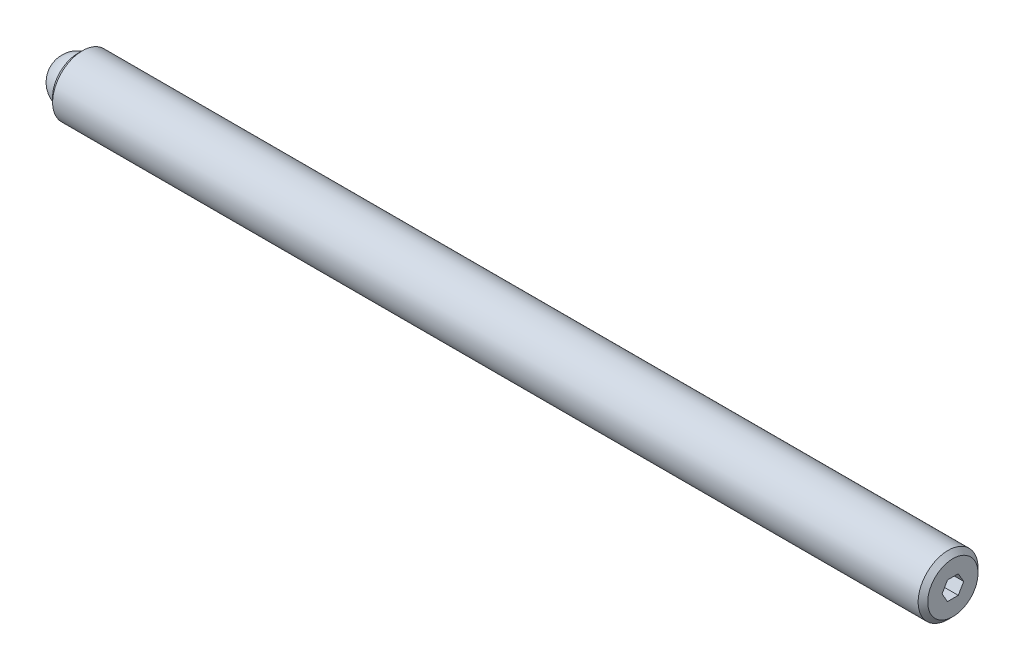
ISO-10303-21;
HEADER;
FILE_DESCRIPTION(('STEP AP214'),'2;1');
FILE_NAME('part.step','',(''),(''),'','','');
FILE_SCHEMA(('AUTOMOTIVE_DESIGN { 1 0 10303 214 1 1 1 1 }'));
ENDSEC;
DATA;
#1=APPLICATION_CONTEXT('core data for automotive mechanical design processes');
#2=APPLICATION_PROTOCOL_DEFINITION('international standard','automotive_design',2000,#1);
#3=PRODUCT_CONTEXT('',#1,'mechanical');
#4=PRODUCT('Part','Part','',(#3));
#5=PRODUCT_RELATED_PRODUCT_CATEGORY('part','',(#4));
#6=PRODUCT_DEFINITION_FORMATION('','',#4);
#7=PRODUCT_DEFINITION_CONTEXT('part definition',#1,'design');
#8=PRODUCT_DEFINITION('design','',#6,#7);
#9=PRODUCT_DEFINITION_SHAPE('','',#8);
#10=(LENGTH_UNIT() NAMED_UNIT(*) SI_UNIT(.MILLI.,.METRE.));
#11=(NAMED_UNIT(*) PLANE_ANGLE_UNIT() SI_UNIT($,.RADIAN.));
#12=(NAMED_UNIT(*) SI_UNIT($,.STERADIAN.) SOLID_ANGLE_UNIT());
#13=UNCERTAINTY_MEASURE_WITH_UNIT(LENGTH_MEASURE(1.E-05),#10,'distance_accuracy_value','');
#14=(GEOMETRIC_REPRESENTATION_CONTEXT(3) GLOBAL_UNCERTAINTY_ASSIGNED_CONTEXT((#13)) GLOBAL_UNIT_ASSIGNED_CONTEXT((#10,
#11,#12)) REPRESENTATION_CONTEXT('',''));
#15=CARTESIAN_POINT('',(0.,0.,0.));
#16=DIRECTION('',(0.,0.,1.));
#17=DIRECTION('',(1.,0.,0.));
#18=AXIS2_PLACEMENT_3D('',#15,#16,#17);
#19=CARTESIAN_POINT('',(0.,0.,0.));
#20=DIRECTION('',(0.,-1.,0.));
#21=DIRECTION('',(0.,0.,1.));
#22=AXIS2_PLACEMENT_3D('',#19,#20,#21);
#23=SPHERICAL_SURFACE('',#22,2.38125);
#24=CARTESIAN_POINT('',(0.,-2.38125,0.));
#25=VERTEX_POINT('',#24);
#26=VERTEX_LOOP('',#25);
#27=FACE_BOUND('',#26,.T.);
#28=ADVANCED_FACE('F43',(#27),#23,.T.);
#29=CLOSED_SHELL('',(#28));
#30=MANIFOLD_SOLID_BREP('B2',#29);
#31=CARTESIAN_POINT('',(92.86875,0.,0.));
#32=DIRECTION('',(-1.,0.,0.));
#33=DIRECTION('',(0.,0.,1.));
#34=AXIS2_PLACEMENT_3D('',#31,#32,#33);
#35=CYLINDRICAL_SURFACE('',#34,3.175);
#36=CARTESIAN_POINT('',(92.36075,0.,0.));
#37=DIRECTION('',(1.,0.,0.));
#38=DIRECTION('',(0.,0.,-1.));
#39=AXIS2_PLACEMENT_3D('',#36,#37,#38);
#40=CIRCLE('',#39,3.175);
#41=CARTESIAN_POINT('',(92.36075,0.,-3.175));
#42=VERTEX_POINT('',#41);
#43=EDGE_CURVE('E41',#42,#42,#40,.F.);
#44=ORIENTED_EDGE('',*,*,#43,.T.);
#45=EDGE_LOOP('',(#44));
#46=FACE_BOUND('',#45,.T.);
#47=CARTESIAN_POINT('',(0.507999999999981,0.,0.));
#48=DIRECTION('',(1.,0.,0.));
#49=DIRECTION('',(0.,0.,-1.));
#50=AXIS2_PLACEMENT_3D('',#47,#48,#49);
#51=CIRCLE('',#50,3.175);
#52=CARTESIAN_POINT('',(0.507999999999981,0.,-3.175));
#53=VERTEX_POINT('',#52);
#54=EDGE_CURVE('E159',#53,#53,#51,.T.);
#55=ORIENTED_EDGE('',*,*,#54,.T.);
#56=EDGE_LOOP('',(#55));
#57=FACE_BOUND('',#56,.T.);
#58=ADVANCED_FACE('F56',(#46,#57),#35,.T.);
#59=CARTESIAN_POINT('',(92.86875,0.,0.));
#60=DIRECTION('',(1.,0.,0.));
#61=DIRECTION('',(0.,0.,-1.));
#62=AXIS2_PLACEMENT_3D('',#59,#60,#61);
#63=PLANE('',#62);
#64=DIRECTION('',(0.,0.866025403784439,-0.5));
#65=VECTOR('',#64,1.);
#66=CARTESIAN_POINT('',(92.86875,-0.9921875,-0.572839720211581));
#67=LINE('',#66,#65);
#68=CARTESIAN_POINT('',(92.86875,-0.9921875,-0.572839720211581));
#69=VERTEX_POINT('',#68);
#70=CARTESIAN_POINT('',(92.86875,0.,-1.14567944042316));
#71=VERTEX_POINT('',#70);
#72=EDGE_CURVE('E71',#69,#71,#67,.T.);
#73=ORIENTED_EDGE('',*,*,#72,.F.);
#74=DIRECTION('',(0.,0.,-1.));
#75=VECTOR('',#74,1.);
#76=CARTESIAN_POINT('',(92.86875,-0.9921875,0.572839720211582));
#77=LINE('',#76,#75);
#78=CARTESIAN_POINT('',(92.86875,-0.9921875,0.572839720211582));
#79=VERTEX_POINT('',#78);
#80=EDGE_CURVE('E155',#79,#69,#77,.T.);
#81=ORIENTED_EDGE('',*,*,#80,.F.);
#82=DIRECTION('',(0.,-0.866025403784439,-0.5));
#83=VECTOR('',#82,1.);
#84=CARTESIAN_POINT('',(92.86875,0.,1.14567944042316));
#85=LINE('',#84,#83);
#86=CARTESIAN_POINT('',(92.86875,0.,1.14567944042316));
#87=VERTEX_POINT('',#86);
#88=EDGE_CURVE('E153',#87,#79,#85,.T.);
#89=ORIENTED_EDGE('',*,*,#88,.F.);
#90=DIRECTION('',(0.,-0.866025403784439,0.5));
#91=VECTOR('',#90,1.);
#92=CARTESIAN_POINT('',(92.86875,0.992187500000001,0.572839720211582));
#93=LINE('',#92,#91);
#94=CARTESIAN_POINT('',(92.86875,0.992187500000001,0.572839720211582));
#95=VERTEX_POINT('',#94);
#96=EDGE_CURVE('E119',#95,#87,#93,.T.);
#97=ORIENTED_EDGE('',*,*,#96,.F.);
#98=DIRECTION('',(0.,0.,1.));
#99=VECTOR('',#98,1.);
#100=CARTESIAN_POINT('',(92.86875,0.9921875,-0.572839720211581));
#101=LINE('',#100,#99);
#102=CARTESIAN_POINT('',(92.86875,0.9921875,-0.572839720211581));
#103=VERTEX_POINT('',#102);
#104=EDGE_CURVE('E149',#103,#95,#101,.T.);
#105=ORIENTED_EDGE('',*,*,#104,.F.);
#106=DIRECTION('',(0.,0.866025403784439,0.5));
#107=VECTOR('',#106,1.);
#108=CARTESIAN_POINT('',(92.86875,0.,-1.14567944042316));
#109=LINE('',#108,#107);
#110=EDGE_CURVE('E145',#71,#103,#109,.T.);
#111=ORIENTED_EDGE('',*,*,#110,.F.);
#112=EDGE_LOOP('',(#73,#81,#89,#97,#105,#111));
#113=FACE_BOUND('',#112,.T.);
#114=CARTESIAN_POINT('',(92.86875,0.,0.));
#115=DIRECTION('',(1.,0.,0.));
#116=DIRECTION('',(0.,0.,-1.));
#117=AXIS2_PLACEMENT_3D('',#114,#115,#116);
#118=CIRCLE('',#117,2.667);
#119=CARTESIAN_POINT('',(92.86875,0.,-2.667));
#120=VERTEX_POINT('',#119);
#121=EDGE_CURVE('E64',#120,#120,#118,.T.);
#122=ORIENTED_EDGE('',*,*,#121,.T.);
#123=EDGE_LOOP('',(#122));
#124=FACE_BOUND('',#123,.T.);
#125=ADVANCED_FACE('F172',(#113,#124),#63,.T.);
#126=CARTESIAN_POINT('',(0.,0.,0.));
#127=DIRECTION('',(1.,0.,0.));
#128=DIRECTION('',(0.,0.,-1.));
#129=AXIS2_PLACEMENT_3D('',#126,#127,#128);
#130=PLANE('',#129);
#131=CARTESIAN_POINT('',(0.,0.,0.));
#132=DIRECTION('',(-1.,0.,0.));
#133=DIRECTION('',(0.,0.,1.));
#134=AXIS2_PLACEMENT_3D('',#131,#132,#133);
#135=CIRCLE('',#134,2.38125);
#136=CARTESIAN_POINT('',(0.,0.,2.38125));
#137=VERTEX_POINT('',#136);
#138=EDGE_CURVE('E227',#137,#137,#135,.T.);
#139=ORIENTED_EDGE('',*,*,#138,.F.);
#140=EDGE_LOOP('',(#139));
#141=FACE_BOUND('',#140,.T.);
#142=CARTESIAN_POINT('',(0.,0.,0.));
#143=DIRECTION('',(1.,0.,0.));
#144=DIRECTION('',(0.,0.,-1.));
#145=AXIS2_PLACEMENT_3D('',#142,#143,#144);
#146=CIRCLE('',#145,2.667);
#147=CARTESIAN_POINT('',(0.,0.,-2.667));
#148=VERTEX_POINT('',#147);
#149=EDGE_CURVE('E167',#148,#148,#146,.F.);
#150=ORIENTED_EDGE('',*,*,#149,.T.);
#151=EDGE_LOOP('',(#150));
#152=FACE_BOUND('',#151,.T.);
#153=ADVANCED_FACE('F184',(#141,#152),#130,.F.);
#154=CARTESIAN_POINT('',(0.507999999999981,0.,0.));
#155=DIRECTION('',(1.,0.,0.));
#156=DIRECTION('',(0.,0.,-1.));
#157=AXIS2_PLACEMENT_3D('',#154,#155,#156);
#158=CONICAL_SURFACE('',#157,3.175,0.785398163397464);
#159=ORIENTED_EDGE('',*,*,#149,.F.);
#160=EDGE_LOOP('',(#159));
#161=FACE_BOUND('',#160,.T.);
#162=ORIENTED_EDGE('',*,*,#54,.F.);
#163=EDGE_LOOP('',(#162));
#164=FACE_BOUND('',#163,.T.);
#165=ADVANCED_FACE('F176',(#161,#164),#158,.T.);
#166=CARTESIAN_POINT('',(92.86875,0.,0.));
#167=DIRECTION('',(-1.,0.,0.));
#168=DIRECTION('',(0.,0.,1.));
#169=AXIS2_PLACEMENT_3D('',#166,#167,#168);
#170=CONICAL_SURFACE('',#169,2.667,0.785398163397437);
#171=ORIENTED_EDGE('',*,*,#43,.F.);
#172=EDGE_LOOP('',(#171));
#173=FACE_BOUND('',#172,.T.);
#174=ORIENTED_EDGE('',*,*,#121,.F.);
#175=EDGE_LOOP('',(#174));
#176=FACE_BOUND('',#175,.T.);
#177=ADVANCED_FACE('F58',(#173,#176),#170,.T.);
#178=CARTESIAN_POINT('',(90.58275,-0.9921875,-0.572839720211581));
#179=DIRECTION('',(0.,-0.5,-0.866025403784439));
#180=DIRECTION('',(0.,0.866025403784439,-0.5));
#181=AXIS2_PLACEMENT_3D('',#178,#179,#180);
#182=PLANE('',#181);
#183=ORIENTED_EDGE('',*,*,#72,.T.);
#184=DIRECTION('',(1.,0.,0.));
#185=VECTOR('',#184,1.);
#186=CARTESIAN_POINT('',(90.58275,0.,-1.14567944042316));
#187=LINE('',#186,#185);
#188=CARTESIAN_POINT('',(90.58275,0.,-1.14567944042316));
#189=VERTEX_POINT('',#188);
#190=EDGE_CURVE('E101',#189,#71,#187,.T.);
#191=ORIENTED_EDGE('',*,*,#190,.F.);
#192=DIRECTION('',(0.,0.866025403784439,-0.5));
#193=VECTOR('',#192,1.);
#194=CARTESIAN_POINT('',(90.58275,-0.9921875,-0.572839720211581));
#195=LINE('',#194,#193);
#196=CARTESIAN_POINT('',(90.58275,-0.9921875,-0.572839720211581));
#197=VERTEX_POINT('',#196);
#198=EDGE_CURVE('E157',#197,#189,#195,.T.);
#199=ORIENTED_EDGE('',*,*,#198,.F.);
#200=DIRECTION('',(1.,0.,0.));
#201=VECTOR('',#200,1.);
#202=CARTESIAN_POINT('',(90.58275,-0.9921875,-0.572839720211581));
#203=LINE('',#202,#201);
#204=EDGE_CURVE('E79',#197,#69,#203,.T.);
#205=ORIENTED_EDGE('',*,*,#204,.T.);
#206=EDGE_LOOP('',(#183,#191,#199,#205));
#207=FACE_BOUND('',#206,.T.);
#208=ADVANCED_FACE('F175',(#207),#182,.F.);
#209=CARTESIAN_POINT('',(90.58275,-0.9921875,0.572839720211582));
#210=DIRECTION('',(0.,-1.,0.));
#211=DIRECTION('',(0.,0.,-1.));
#212=AXIS2_PLACEMENT_3D('',#209,#210,#211);
#213=PLANE('',#212);
#214=ORIENTED_EDGE('',*,*,#80,.T.);
#215=ORIENTED_EDGE('',*,*,#204,.F.);
#216=DIRECTION('',(0.,0.,-1.));
#217=VECTOR('',#216,1.);
#218=CARTESIAN_POINT('',(90.58275,-0.9921875,0.572839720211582));
#219=LINE('',#218,#217);
#220=CARTESIAN_POINT('',(90.58275,-0.9921875,0.572839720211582));
#221=VERTEX_POINT('',#220);
#222=EDGE_CURVE('E131',#221,#197,#219,.T.);
#223=ORIENTED_EDGE('',*,*,#222,.F.);
#224=DIRECTION('',(1.,0.,0.));
#225=VECTOR('',#224,1.);
#226=CARTESIAN_POINT('',(90.58275,-0.9921875,0.572839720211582));
#227=LINE('',#226,#225);
#228=EDGE_CURVE('E123',#221,#79,#227,.T.);
#229=ORIENTED_EDGE('',*,*,#228,.T.);
#230=EDGE_LOOP('',(#214,#215,#223,#229));
#231=FACE_BOUND('',#230,.T.);
#232=ADVANCED_FACE('F182',(#231),#213,.F.);
#233=CARTESIAN_POINT('',(90.58275,0.,1.14567944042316));
#234=DIRECTION('',(0.,-0.5,0.866025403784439));
#235=DIRECTION('',(0.,-0.866025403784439,-0.5));
#236=AXIS2_PLACEMENT_3D('',#233,#234,#235);
#237=PLANE('',#236);
#238=ORIENTED_EDGE('',*,*,#88,.T.);
#239=ORIENTED_EDGE('',*,*,#228,.F.);
#240=DIRECTION('',(0.,-0.866025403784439,-0.5));
#241=VECTOR('',#240,1.);
#242=CARTESIAN_POINT('',(90.58275,0.,1.14567944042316));
#243=LINE('',#242,#241);
#244=CARTESIAN_POINT('',(90.58275,0.,1.14567944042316));
#245=VERTEX_POINT('',#244);
#246=EDGE_CURVE('E127',#245,#221,#243,.T.);
#247=ORIENTED_EDGE('',*,*,#246,.F.);
#248=DIRECTION('',(1.,0.,0.));
#249=VECTOR('',#248,1.);
#250=CARTESIAN_POINT('',(90.58275,0.,1.14567944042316));
#251=LINE('',#250,#249);
#252=EDGE_CURVE('E112',#245,#87,#251,.T.);
#253=ORIENTED_EDGE('',*,*,#252,.T.);
#254=EDGE_LOOP('',(#238,#239,#247,#253));
#255=FACE_BOUND('',#254,.T.);
#256=ADVANCED_FACE('F128',(#255),#237,.F.);
#257=CARTESIAN_POINT('',(90.58275,0.992187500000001,0.572839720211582));
#258=DIRECTION('',(0.,0.5,0.866025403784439));
#259=DIRECTION('',(0.,-0.866025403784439,0.5));
#260=AXIS2_PLACEMENT_3D('',#257,#258,#259);
#261=PLANE('',#260);
#262=ORIENTED_EDGE('',*,*,#96,.T.);
#263=ORIENTED_EDGE('',*,*,#252,.F.);
#264=DIRECTION('',(0.,-0.866025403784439,0.5));
#265=VECTOR('',#264,1.);
#266=CARTESIAN_POINT('',(90.58275,0.992187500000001,0.572839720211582));
#267=LINE('',#266,#265);
#268=CARTESIAN_POINT('',(90.58275,0.992187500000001,0.572839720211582));
#269=VERTEX_POINT('',#268);
#270=EDGE_CURVE('E116',#269,#245,#267,.T.);
#271=ORIENTED_EDGE('',*,*,#270,.F.);
#272=DIRECTION('',(1.,0.,0.));
#273=VECTOR('',#272,1.);
#274=CARTESIAN_POINT('',(90.58275,0.992187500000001,0.572839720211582));
#275=LINE('',#274,#273);
#276=EDGE_CURVE('E124',#269,#95,#275,.T.);
#277=ORIENTED_EDGE('',*,*,#276,.T.);
#278=EDGE_LOOP('',(#262,#263,#271,#277));
#279=FACE_BOUND('',#278,.T.);
#280=ADVANCED_FACE('F114',(#279),#261,.F.);
#281=CARTESIAN_POINT('',(90.58275,0.9921875,-0.572839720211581));
#282=DIRECTION('',(0.,1.,0.));
#283=DIRECTION('',(0.,0.,1.));
#284=AXIS2_PLACEMENT_3D('',#281,#282,#283);
#285=PLANE('',#284);
#286=ORIENTED_EDGE('',*,*,#104,.T.);
#287=ORIENTED_EDGE('',*,*,#276,.F.);
#288=DIRECTION('',(0.,0.,1.));
#289=VECTOR('',#288,1.);
#290=CARTESIAN_POINT('',(90.58275,0.9921875,-0.572839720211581));
#291=LINE('',#290,#289);
#292=CARTESIAN_POINT('',(90.58275,0.9921875,-0.572839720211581));
#293=VERTEX_POINT('',#292);
#294=EDGE_CURVE('E137',#293,#269,#291,.T.);
#295=ORIENTED_EDGE('',*,*,#294,.F.);
#296=DIRECTION('',(1.,0.,0.));
#297=VECTOR('',#296,1.);
#298=CARTESIAN_POINT('',(90.58275,0.9921875,-0.572839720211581));
#299=LINE('',#298,#297);
#300=EDGE_CURVE('E162',#293,#103,#299,.T.);
#301=ORIENTED_EDGE('',*,*,#300,.T.);
#302=EDGE_LOOP('',(#286,#287,#295,#301));
#303=FACE_BOUND('',#302,.T.);
#304=ADVANCED_FACE('F203',(#303),#285,.F.);
#305=CARTESIAN_POINT('',(90.58275,0.,-1.14567944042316));
#306=DIRECTION('',(0.,0.5,-0.866025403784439));
#307=DIRECTION('',(0.,0.866025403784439,0.5));
#308=AXIS2_PLACEMENT_3D('',#305,#306,#307);
#309=PLANE('',#308);
#310=ORIENTED_EDGE('',*,*,#110,.T.);
#311=ORIENTED_EDGE('',*,*,#300,.F.);
#312=DIRECTION('',(0.,0.866025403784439,0.5));
#313=VECTOR('',#312,1.);
#314=CARTESIAN_POINT('',(90.58275,0.,-1.14567944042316));
#315=LINE('',#314,#313);
#316=EDGE_CURVE('E139',#189,#293,#315,.T.);
#317=ORIENTED_EDGE('',*,*,#316,.F.);
#318=ORIENTED_EDGE('',*,*,#190,.T.);
#319=EDGE_LOOP('',(#310,#311,#317,#318));
#320=FACE_BOUND('',#319,.T.);
#321=ADVANCED_FACE('F200',(#320),#309,.F.);
#322=CARTESIAN_POINT('',(90.58275,0.,0.));
#323=DIRECTION('',(1.,0.,0.));
#324=DIRECTION('',(0.,0.,-1.));
#325=AXIS2_PLACEMENT_3D('',#322,#323,#324);
#326=PLANE('',#325);
#327=ORIENTED_EDGE('',*,*,#198,.T.);
#328=ORIENTED_EDGE('',*,*,#316,.T.);
#329=ORIENTED_EDGE('',*,*,#294,.T.);
#330=ORIENTED_EDGE('',*,*,#270,.T.);
#331=ORIENTED_EDGE('',*,*,#246,.T.);
#332=ORIENTED_EDGE('',*,*,#222,.T.);
#333=EDGE_LOOP('',(#327,#328,#329,#330,#331,#332));
#334=FACE_BOUND('',#333,.T.);
#335=ADVANCED_FACE('F134',(#334),#326,.T.);
#336=CARTESIAN_POINT('',(1.984375,0.,0.));
#337=DIRECTION('',(-1.,0.,0.));
#338=DIRECTION('',(0.,0.,1.));
#339=AXIS2_PLACEMENT_3D('',#336,#337,#338);
#340=CYLINDRICAL_SURFACE('',#339,2.38125);
#341=CARTESIAN_POINT('',(1.984375,0.,0.));
#342=DIRECTION('',(-1.,0.,0.));
#343=DIRECTION('',(0.,0.,1.));
#344=AXIS2_PLACEMENT_3D('',#341,#342,#343);
#345=CIRCLE('',#344,2.38125);
#346=CARTESIAN_POINT('',(1.984375,0.,2.38125));
#347=VERTEX_POINT('',#346);
#348=EDGE_CURVE('E146',#347,#347,#345,.T.);
#349=ORIENTED_EDGE('',*,*,#348,.F.);
#350=EDGE_LOOP('',(#349));
#351=FACE_BOUND('',#350,.T.);
#352=ORIENTED_EDGE('',*,*,#138,.T.);
#353=EDGE_LOOP('',(#352));
#354=FACE_BOUND('',#353,.T.);
#355=ADVANCED_FACE('F216',(#351,#354),#340,.F.);
#356=CARTESIAN_POINT('',(1.984375,0.,0.));
#357=DIRECTION('',(-1.,0.,0.));
#358=DIRECTION('',(0.,0.,1.));
#359=AXIS2_PLACEMENT_3D('',#356,#357,#358);
#360=PLANE('',#359);
#361=ORIENTED_EDGE('',*,*,#348,.T.);
#362=EDGE_LOOP('',(#361));
#363=FACE_BOUND('',#362,.T.);
#364=ADVANCED_FACE('F219',(#363),#360,.T.);
#365=CLOSED_SHELL('',(#58,#125,#153,#165,#177,#208,#232,#256,#280,#304,#321,#335,#355,#364));
#366=MANIFOLD_SOLID_BREP('B6',#365);
#367=ADVANCED_BREP_SHAPE_REPRESENTATION('',(#18,#30,#366),#14);
#368=SHAPE_DEFINITION_REPRESENTATION(#9,#367);
ENDSEC;
END-ISO-10303-21;
